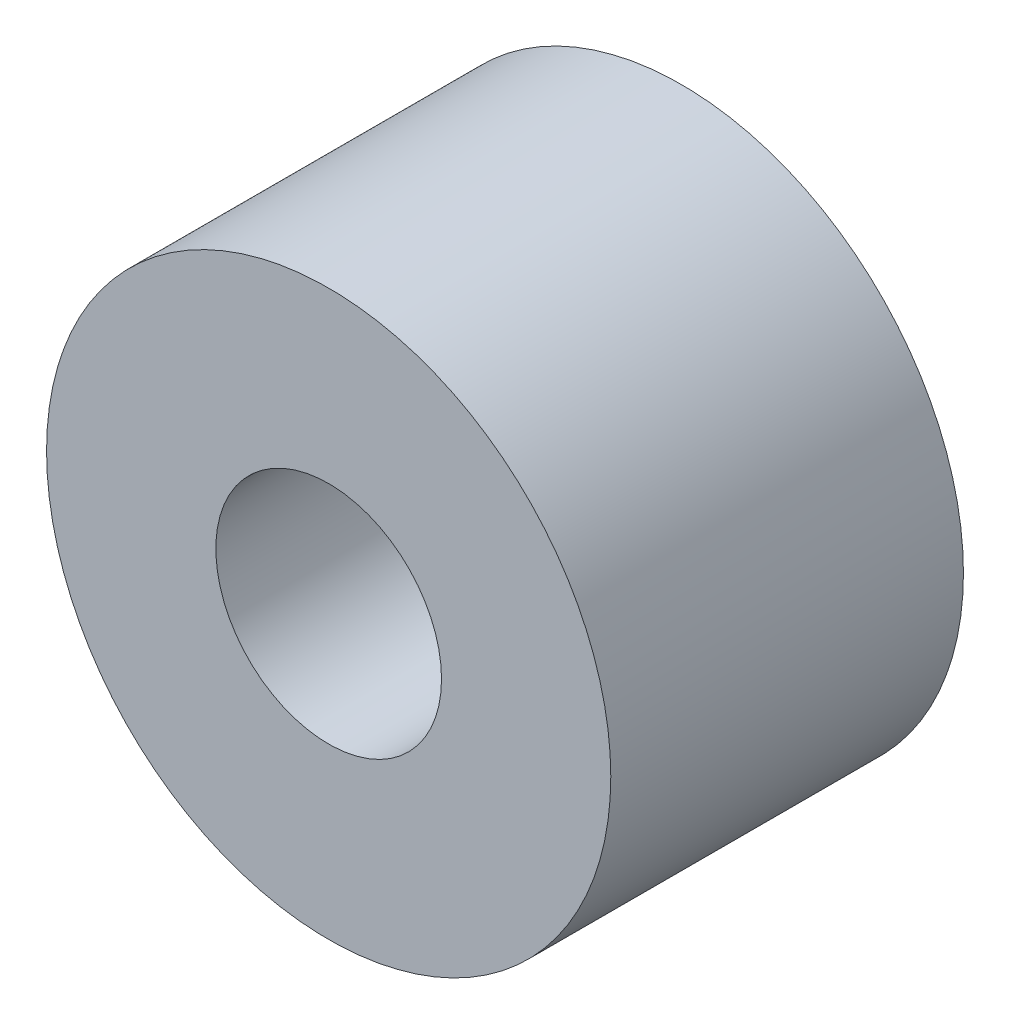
ISO-10303-21;
HEADER;
FILE_DESCRIPTION(('STEP AP214'),'2;1');
FILE_NAME('part.step','',(''),(''),'','','');
FILE_SCHEMA(('AUTOMOTIVE_DESIGN { 1 0 10303 214 1 1 1 1 }'));
ENDSEC;
DATA;
#1=APPLICATION_CONTEXT('core data for automotive mechanical design processes');
#2=APPLICATION_PROTOCOL_DEFINITION('international standard','automotive_design',2000,#1);
#3=PRODUCT_CONTEXT('',#1,'mechanical');
#4=PRODUCT('Part','Part','',(#3));
#5=PRODUCT_RELATED_PRODUCT_CATEGORY('part','',(#4));
#6=PRODUCT_DEFINITION_FORMATION('','',#4);
#7=PRODUCT_DEFINITION_CONTEXT('part definition',#1,'design');
#8=PRODUCT_DEFINITION('design','',#6,#7);
#9=PRODUCT_DEFINITION_SHAPE('','',#8);
#10=(LENGTH_UNIT() NAMED_UNIT(*) SI_UNIT(.MILLI.,.METRE.));
#11=(NAMED_UNIT(*) PLANE_ANGLE_UNIT() SI_UNIT($,.RADIAN.));
#12=(NAMED_UNIT(*) SI_UNIT($,.STERADIAN.) SOLID_ANGLE_UNIT());
#13=UNCERTAINTY_MEASURE_WITH_UNIT(LENGTH_MEASURE(1.E-05),#10,'distance_accuracy_value','');
#14=(GEOMETRIC_REPRESENTATION_CONTEXT(3) GLOBAL_UNCERTAINTY_ASSIGNED_CONTEXT((#13)) GLOBAL_UNIT_ASSIGNED_CONTEXT((#10,
#11,#12)) REPRESENTATION_CONTEXT('',''));
#15=CARTESIAN_POINT('',(0.,0.,0.));
#16=DIRECTION('',(0.,0.,1.));
#17=DIRECTION('',(1.,0.,0.));
#18=AXIS2_PLACEMENT_3D('',#15,#16,#17);
#19=CARTESIAN_POINT('',(0.,0.,-5.));
#20=DIRECTION('',(0.,0.,1.));
#21=DIRECTION('',(1.,0.,0.));
#22=AXIS2_PLACEMENT_3D('',#19,#20,#21);
#23=CYLINDRICAL_SURFACE('',#22,4.);
#24=CARTESIAN_POINT('',(0.,0.,-5.));
#25=DIRECTION('',(0.,0.,1.));
#26=DIRECTION('',(1.,0.,0.));
#27=AXIS2_PLACEMENT_3D('',#24,#25,#26);
#28=CIRCLE('',#27,4.);
#29=CARTESIAN_POINT('',(4.,0.,-5.));
#30=VERTEX_POINT('',#29);
#31=EDGE_CURVE('E10',#30,#30,#28,.T.);
#32=ORIENTED_EDGE('',*,*,#31,.T.);
#33=EDGE_LOOP('',(#32));
#34=FACE_BOUND('',#33,.T.);
#35=CARTESIAN_POINT('',(0.,0.,0.));
#36=DIRECTION('',(0.,0.,1.));
#37=DIRECTION('',(1.,0.,0.));
#38=AXIS2_PLACEMENT_3D('',#35,#36,#37);
#39=CIRCLE('',#38,4.);
#40=CARTESIAN_POINT('',(4.,0.,0.));
#41=VERTEX_POINT('',#40);
#42=EDGE_CURVE('E35',#41,#41,#39,.T.);
#43=ORIENTED_EDGE('',*,*,#42,.F.);
#44=EDGE_LOOP('',(#43));
#45=FACE_BOUND('',#44,.T.);
#46=ADVANCED_FACE('F32',(#34,#45),#23,.T.);
#47=CARTESIAN_POINT('',(0.,0.,-5.));
#48=DIRECTION('',(0.,0.,1.));
#49=DIRECTION('',(1.,0.,0.));
#50=AXIS2_PLACEMENT_3D('',#47,#48,#49);
#51=PLANE('',#50);
#52=CARTESIAN_POINT('',(0.,0.,-5.));
#53=DIRECTION('',(0.,0.,1.));
#54=DIRECTION('',(1.,0.,0.));
#55=AXIS2_PLACEMENT_3D('',#52,#53,#54);
#56=CIRCLE('',#55,1.6);
#57=CARTESIAN_POINT('',(1.6,0.,-5.));
#58=VERTEX_POINT('',#57);
#59=EDGE_CURVE('E42',#58,#58,#56,.T.);
#60=ORIENTED_EDGE('',*,*,#59,.T.);
#61=EDGE_LOOP('',(#60));
#62=FACE_BOUND('',#61,.T.);
#63=ORIENTED_EDGE('',*,*,#31,.F.);
#64=EDGE_LOOP('',(#63));
#65=FACE_BOUND('',#64,.T.);
#66=ADVANCED_FACE('F50',(#62,#65),#51,.F.);
#67=CARTESIAN_POINT('',(0.,0.,0.));
#68=DIRECTION('',(0.,0.,1.));
#69=DIRECTION('',(1.,0.,0.));
#70=AXIS2_PLACEMENT_3D('',#67,#68,#69);
#71=PLANE('',#70);
#72=CARTESIAN_POINT('',(0.,0.,0.));
#73=DIRECTION('',(0.,0.,1.));
#74=DIRECTION('',(1.,0.,0.));
#75=AXIS2_PLACEMENT_3D('',#72,#73,#74);
#76=CIRCLE('',#75,1.6);
#77=CARTESIAN_POINT('',(1.6,0.,0.));
#78=VERTEX_POINT('',#77);
#79=EDGE_CURVE('E44',#78,#78,#76,.T.);
#80=ORIENTED_EDGE('',*,*,#79,.F.);
#81=EDGE_LOOP('',(#80));
#82=FACE_BOUND('',#81,.T.);
#83=ORIENTED_EDGE('',*,*,#42,.T.);
#84=EDGE_LOOP('',(#83));
#85=FACE_BOUND('',#84,.T.);
#86=ADVANCED_FACE('F56',(#82,#85),#71,.T.);
#87=CARTESIAN_POINT('',(0.,0.,-5.));
#88=DIRECTION('',(0.,0.,1.));
#89=DIRECTION('',(1.,0.,0.));
#90=AXIS2_PLACEMENT_3D('',#87,#88,#89);
#91=CYLINDRICAL_SURFACE('',#90,1.6);
#92=ORIENTED_EDGE('',*,*,#59,.F.);
#93=EDGE_LOOP('',(#92));
#94=FACE_BOUND('',#93,.T.);
#95=ORIENTED_EDGE('',*,*,#79,.T.);
#96=EDGE_LOOP('',(#95));
#97=FACE_BOUND('',#96,.T.);
#98=ADVANCED_FACE('F53',(#94,#97),#91,.F.);
#99=CLOSED_SHELL('',(#46,#66,#86,#98));
#100=MANIFOLD_SOLID_BREP('B2',#99);
#101=ADVANCED_BREP_SHAPE_REPRESENTATION('',(#18,#100),#14);
#102=SHAPE_DEFINITION_REPRESENTATION(#9,#101);
ENDSEC;
END-ISO-10303-21;
